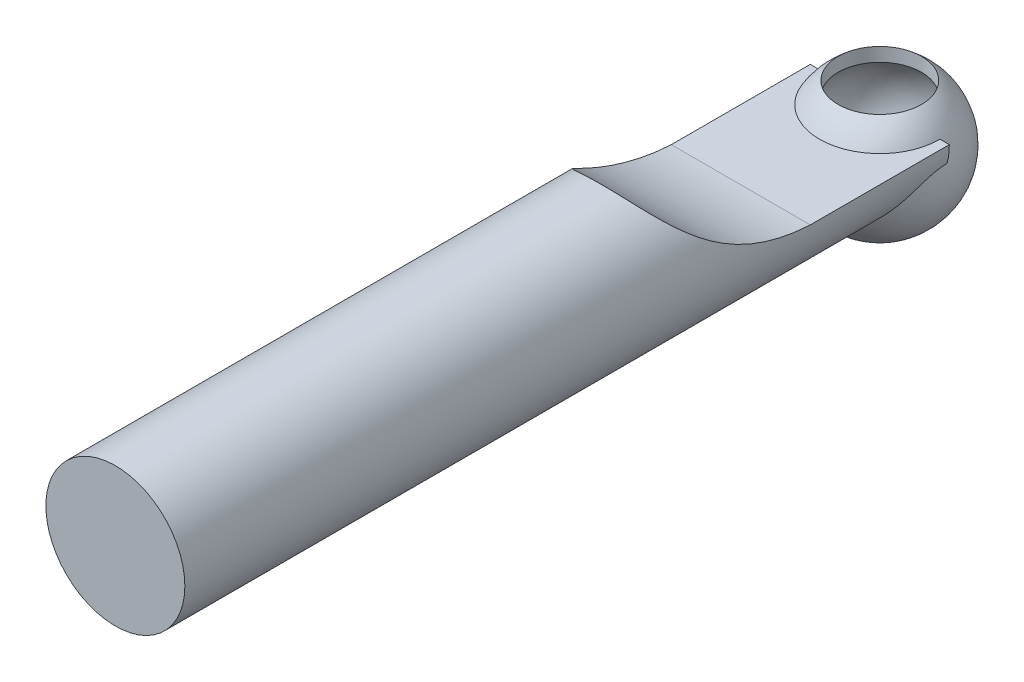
from build123d import *

# Parameters (mm, degrees)
SKETCH2_R           = 10
BOSS_EXTRUDE1_DEPTH = 50
CUT_EXTRUDE1_DEPTH  = 50
SKETCH5_R           = 6
CUT_EXTRUDE2_DEPTH  = 50
BOSS_EXTRUDE2_DEPTH = 10


with BuildPart() as part:
    # Sketch2 → Boss-Extrude1 (new, symmetric)
    with BuildSketch(Plane.XY):
        Circle(SKETCH2_R)
    extrude(amount=BOSS_EXTRUDE1_DEPTH, both=True)

    # Sketch3 → Cut-Extrude1 (cut, symmetric)
    with BuildSketch(Plane(origin=(0, 0, 0), x_dir=(0, 0, -1), z_dir=(1, 0, 0))):
        with BuildLine():
            Line((50, 0), (40, 0))
            ThreePointArc((40, 0), (28.954030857, 2.908061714), (20, 10))
            Line((20, 10), (50, 10))
            Line((50, 10), (50, 0))
        make_face()
    extrude(amount=CUT_EXTRUDE1_DEPTH, both=True, mode=Mode.SUBTRACT)



with BuildPart() as body_2:
    # Sketch4 → Revolve1 (revolve)
    with BuildSketch(Plane(origin=(0, -5, 0), x_dir=(1, 0, 0), z_dir=(0, 1, 0))):
        with BuildLine():
            Line((0, 70), (0, 68))
            ThreePointArc((0, 68), (8, 60), (0, 52))
            Line((0, 52), (0, 50))
            ThreePointArc((0, 50), (10, 60), (0, 70))
        make_face()
    revolve(axis=Axis((0, -5, -50), (0, 0, -1)))

    # Sketch5 → Cut-Extrude2 (cut, symmetric)
    with BuildSketch(Plane(origin=(0, -5, 0), x_dir=(1, 0, 0), z_dir=(0, 1, 0))):
        with Locations(Location((0, 60, 0), (0, 0, 270))):
            Circle(SKETCH5_R)
    extrude(amount=CUT_EXTRUDE2_DEPTH, both=True, mode=Mode.SUBTRACT)


with BuildPart() as part_1:
    add(part.part)

    add(body_2.part)  # Boss-Extrude2 merges body 2
    # Sketch6 → Boss-Extrude2 (add)
    with BuildSketch(Plane(origin=(0, 0, -50), x_dir=(-1, 0, 0), z_dir=(0, 0, -1))):
        with BuildLine():
            Line((10, 0), (-10, 0))
            ThreePointArc((-10, 0), (0, -10), (10, 0))
        make_face()
    extrude(amount=BOSS_EXTRUDE2_DEPTH)

    # Sketch7 → Cut-Revolve1 (revolve, cut)
    with BuildSketch(Plane(origin=(0, -5, 0), x_dir=(1, 0, 0), z_dir=(0, 1, 0))):
        with BuildLine():
            Line((0, 68.5), (0, 51.5))
            ThreePointArc((0, 51.5), (8.5, 60), (0, 68.5))
        make_face()
    revolve(axis=Axis((0, -5, -74.894708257), (0, 0, 1)), mode=Mode.SUBTRACT)


solid = part_1.part
